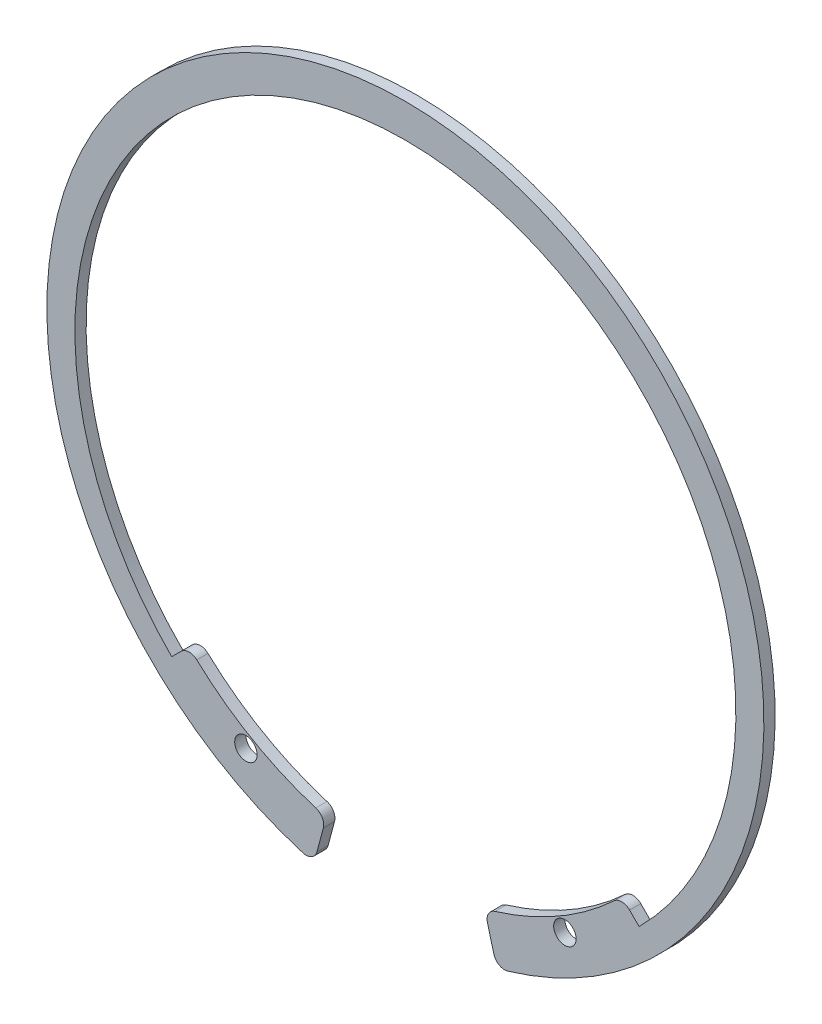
from build123d import *

# Parameters (mm, degrees)
ESQUISSE1_R          = 1
BASE_EXTRUSION_DEPTH = 1


with BuildPart() as part:
    # Esquisse1 → Base-Extrusion (new body)
    with BuildSketch(Plane.XY):
        with BuildLine():
            Line((7.895225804, -29.465383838), (7.324349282, -27.334843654))
            ThreePointArc((7.324349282, -27.334843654), (7.415554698, -26.591396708), (7.99750607, -26.11984142))
            ThreePointArc((7.99750607, -26.11984142), (13.658387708, -23.65702146), (18.621693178, -19.985964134))
            ThreePointArc((18.621693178, -19.985964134), (19.321047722, -19.717757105), (20.010494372, -20.010494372))
            Line((20.010494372, -20.010494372), (20.859650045, -20.859650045))
            ThreePointArc((20.859650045, -20.859650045), (0, 29.5), (-20.859650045, -20.859650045))
            Line((-20.859650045, -20.859650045), (-20.010494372, -20.010494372))
            ThreePointArc((-20.010494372, -20.010494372), (-19.321047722, -19.717757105), (-18.621693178, -19.985964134))
            ThreePointArc((-18.621693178, -19.985964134), (-13.658387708, -23.65702146), (-7.99750607, -26.11984142))
            ThreePointArc((-7.99750607, -26.11984142), (-7.415554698, -26.591396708), (-7.324349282, -27.334843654))
            Line((-7.324349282, -27.334843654), (-7.895225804, -29.465383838))
            ThreePointArc((-7.895225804, -29.465383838), (-8.373362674, -30.079526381), (-9.146995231, -30.164841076))
            ThreePointArc((-9.146995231, -30.164841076), (0, 32.5), (9.146995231, -30.164841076))
            ThreePointArc((9.146995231, -30.164841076), (8.373362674, -30.079526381), (7.895225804, -29.465383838))
        make_face()
        with Locations((-14.234718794, -24.629881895)):
            Circle(ESQUISSE1_R, mode=Mode.SUBTRACT)
        with Locations(Location((14.234718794, -24.629881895, 0), (0, 0, 180))):
            Circle(ESQUISSE1_R, mode=Mode.SUBTRACT)
    extrude(amount=BASE_EXTRUSION_DEPTH)


solid = part.part
